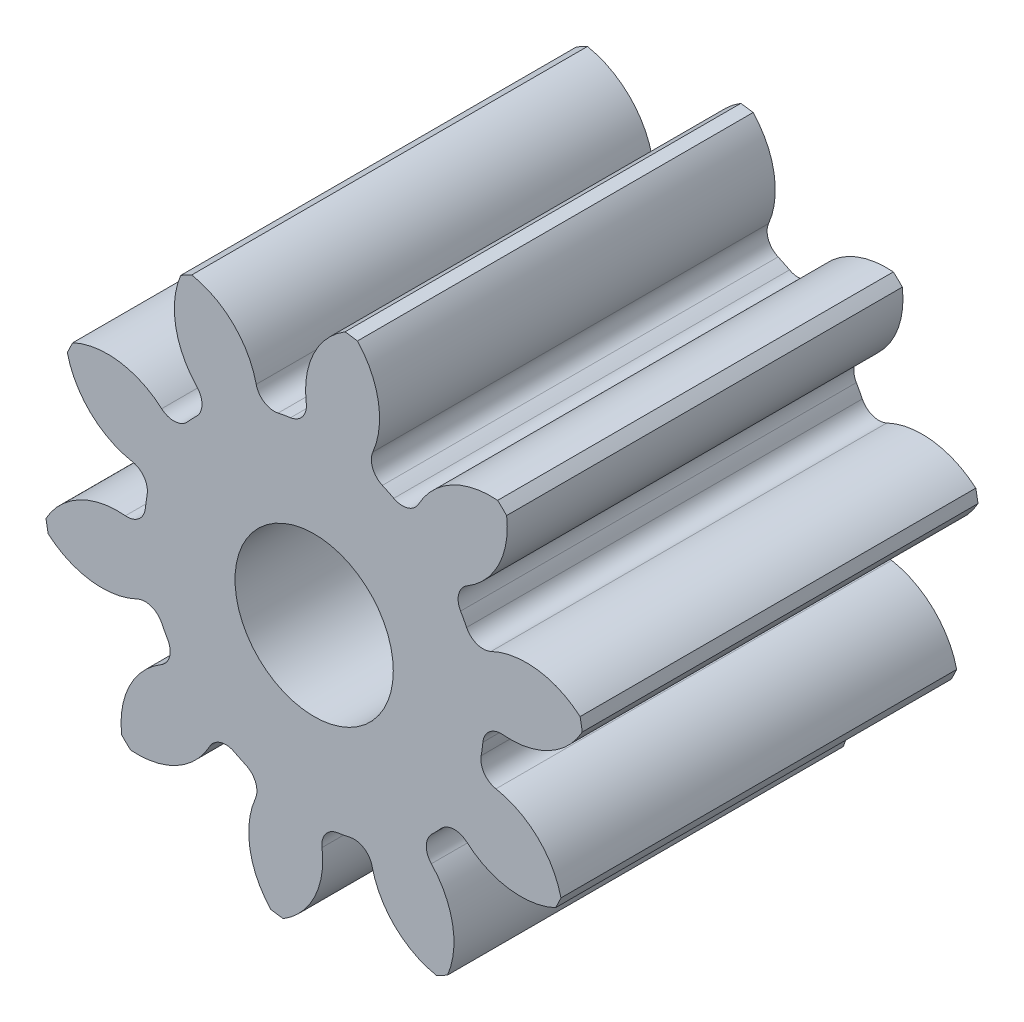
from build123d import *

# Parameters (mm, degrees)
SKETCH3_R         = 60.96
GEARBODY_DEPTH    = 88.9
TOOTHCUT_DEPTH    = 124.836396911
CIRPATTERN1_COUNT = 10
BOREDIA_R         = 17.78
BORE_DEPTH        = 12700


with BuildPart() as part:
    # Sketch3 → gearBody (new body)
    with BuildSketch(Plane.XY):
        Circle(SKETCH3_R)
    extrude(amount=GEARBODY_DEPTH)

    # Sketch2 → toothCut (cut, through all)
    with BuildSketch(Plane.XY):
        with BuildLine():
            ThreePointArc((37.519958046, -6.62289576), (37.741285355, -5.21587766), (37.909867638, -3.801570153))
            ThreePointArc((37.909867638, -3.801570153), (39.394315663, -1.023222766), (42.404992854, -0.096603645))
            ThreePointArc((42.404992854, -0.096603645), (53.433557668, 2.359671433), (60.96, 10.786722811))
            ThreePointArc((60.96, 10.786722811), (61.324127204, -8.475046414), (55.749442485, -26.916066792))
            ThreePointArc((55.749442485, -26.916066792), (50.790711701, -16.763553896), (40.841725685, -11.408163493))
            ThreePointArc((40.841725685, -11.408163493), (38.195216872, -9.699716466), (37.519958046, -6.62289576))
        make_face()
    toothcut = extrude(amount=TOOTHCUT_DEPTH, mode=Mode.SUBTRACT)

    # CirPattern1: toothCut ×10 about axis
    cirpattern1_axis = Axis((0, 0, 0), (0, 0, 1))
    for i in range(1, CIRPATTERN1_COUNT):
        add(toothcut.rotate(cirpattern1_axis, i * 360 / CIRPATTERN1_COUNT), mode=Mode.SUBTRACT)

    # boreDia → bore (cut, symmetric)
    with BuildSketch(Plane.XY):
        Circle(BOREDIA_R)
    extrude(amount=BORE_DEPTH, both=True, mode=Mode.SUBTRACT)


solid = part.part
